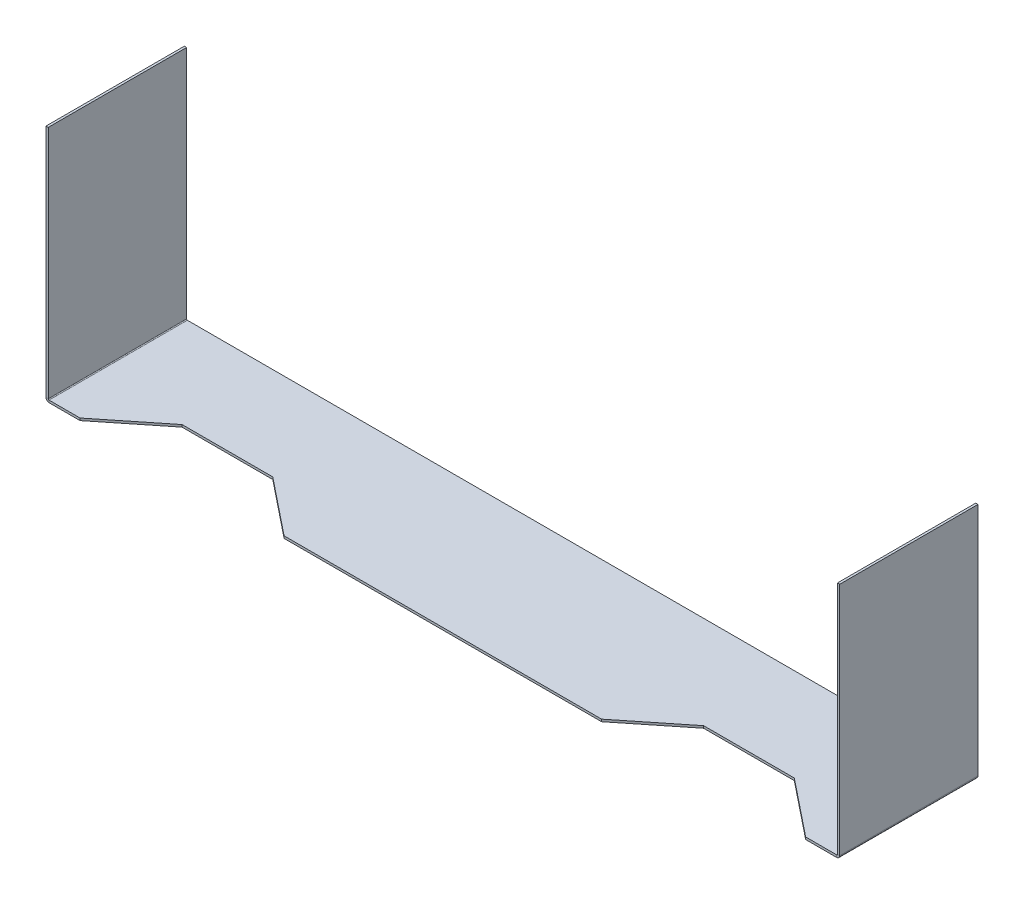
ISO-10303-21;
HEADER;
FILE_DESCRIPTION(('STEP AP214'),'2;1');
FILE_NAME('part.step','',(''),(''),'','','');
FILE_SCHEMA(('AUTOMOTIVE_DESIGN { 1 0 10303 214 1 1 1 1 }'));
ENDSEC;
DATA;
#1=APPLICATION_CONTEXT('core data for automotive mechanical design processes');
#2=APPLICATION_PROTOCOL_DEFINITION('international standard','automotive_design',2000,#1);
#3=PRODUCT_CONTEXT('',#1,'mechanical');
#4=PRODUCT('Part','Part','',(#3));
#5=PRODUCT_RELATED_PRODUCT_CATEGORY('part','',(#4));
#6=PRODUCT_DEFINITION_FORMATION('','',#4);
#7=PRODUCT_DEFINITION_CONTEXT('part definition',#1,'design');
#8=PRODUCT_DEFINITION('design','',#6,#7);
#9=PRODUCT_DEFINITION_SHAPE('','',#8);
#10=(LENGTH_UNIT() NAMED_UNIT(*) SI_UNIT(.MILLI.,.METRE.));
#11=(NAMED_UNIT(*) PLANE_ANGLE_UNIT() SI_UNIT($,.RADIAN.));
#12=(NAMED_UNIT(*) SI_UNIT($,.STERADIAN.) SOLID_ANGLE_UNIT());
#13=UNCERTAINTY_MEASURE_WITH_UNIT(LENGTH_MEASURE(1.E-05),#10,'distance_accuracy_value','');
#14=(GEOMETRIC_REPRESENTATION_CONTEXT(3) GLOBAL_UNCERTAINTY_ASSIGNED_CONTEXT((#13)) GLOBAL_UNIT_ASSIGNED_CONTEXT((#10,
#11,#12)) REPRESENTATION_CONTEXT('',''));
#15=CARTESIAN_POINT('',(0.,0.,0.));
#16=DIRECTION('',(0.,0.,1.));
#17=DIRECTION('',(1.,0.,0.));
#18=AXIS2_PLACEMENT_3D('',#15,#16,#17);
#19=CARTESIAN_POINT('',(698.,2.73660000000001,122.));
#20=DIRECTION('',(0.,0.,1.));
#21=DIRECTION('',(1.,0.,0.));
#22=AXIS2_PLACEMENT_3D('',#19,#20,#21);
#23=PLANE('',#22);
#24=DIRECTION('',(1.,0.,0.));
#25=VECTOR('',#24,1.);
#26=CARTESIAN_POINT('',(0.,0.,122.));
#27=LINE('',#26,#25);
#28=CARTESIAN_POINT('',(2.73659999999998,0.,122.));
#29=VERTEX_POINT('',#28);
#30=CARTESIAN_POINT('',(30.,0.,122.));
#31=VERTEX_POINT('',#30);
#32=EDGE_CURVE('E191',#29,#31,#27,.T.);
#33=ORIENTED_EDGE('',*,*,#32,.T.);
#34=DIRECTION('',(0.,1.,0.));
#35=VECTOR('',#34,1.);
#36=CARTESIAN_POINT('',(30.,2.,122.));
#37=LINE('',#36,#35);
#38=CARTESIAN_POINT('',(30.,2.,122.));
#39=VERTEX_POINT('',#38);
#40=EDGE_CURVE('E171',#39,#31,#37,.F.);
#41=ORIENTED_EDGE('',*,*,#40,.F.);
#42=DIRECTION('',(1.,0.,0.));
#43=VECTOR('',#42,1.);
#44=CARTESIAN_POINT('',(0.,2.,122.));
#45=LINE('',#44,#43);
#46=CARTESIAN_POINT('',(2.73659999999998,2.,122.));
#47=VERTEX_POINT('',#46);
#48=EDGE_CURVE('E226',#47,#39,#45,.T.);
#49=ORIENTED_EDGE('',*,*,#48,.F.);
#50=DIRECTION('',(0.,-1.,0.));
#51=VECTOR('',#50,1.);
#52=CARTESIAN_POINT('',(2.73659999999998,2.,122.));
#53=LINE('',#52,#51);
#54=EDGE_CURVE('E44',#47,#29,#53,.T.);
#55=ORIENTED_EDGE('',*,*,#54,.T.);
#56=EDGE_LOOP('',(#33,#41,#49,#55));
#57=FACE_BOUND('',#56,.T.);
#58=ADVANCED_FACE('F36',(#57),#23,.T.);
#59=CARTESIAN_POINT('',(210.,2.,122.));
#60=VERTEX_POINT('',#59);
#61=CARTESIAN_POINT('',(490.,2.,122.));
#62=VERTEX_POINT('',#61);
#63=EDGE_CURVE('E228',#60,#62,#45,.T.);
#64=ORIENTED_EDGE('',*,*,#63,.F.);
#65=DIRECTION('',(0.,1.,0.));
#66=VECTOR('',#65,1.);
#67=CARTESIAN_POINT('',(210.,2.,122.));
#68=LINE('',#67,#66);
#69=CARTESIAN_POINT('',(210.,0.,122.));
#70=VERTEX_POINT('',#69);
#71=EDGE_CURVE('E184',#60,#70,#68,.F.);
#72=ORIENTED_EDGE('',*,*,#71,.T.);
#73=CARTESIAN_POINT('',(490.,0.,122.));
#74=VERTEX_POINT('',#73);
#75=EDGE_CURVE('E197',#70,#74,#27,.T.);
#76=ORIENTED_EDGE('',*,*,#75,.T.);
#77=DIRECTION('',(0.,1.,0.));
#78=VECTOR('',#77,1.);
#79=CARTESIAN_POINT('',(490.,2.,122.));
#80=LINE('',#79,#78);
#81=EDGE_CURVE('E244',#62,#74,#80,.F.);
#82=ORIENTED_EDGE('',*,*,#81,.F.);
#83=EDGE_LOOP('',(#64,#72,#76,#82));
#84=FACE_BOUND('',#83,.T.);
#85=ADVANCED_FACE('F284',(#84),#23,.T.);
#86=CARTESIAN_POINT('',(0.,2.,122.));
#87=DIRECTION('',(0.,1.,0.));
#88=DIRECTION('',(0.,0.,1.));
#89=AXIS2_PLACEMENT_3D('',#86,#87,#88);
#90=PLANE('',#89);
#91=ORIENTED_EDGE('',*,*,#48,.T.);
#92=DIRECTION('',(-0.78086880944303,0.,0.624695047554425));
#93=VECTOR('',#92,1.);
#94=CARTESIAN_POINT('',(11.7073170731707,2.,136.634146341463));
#95=LINE('',#94,#93);
#96=CARTESIAN_POINT('',(80.,2.,82.));
#97=VERTEX_POINT('',#96);
#98=EDGE_CURVE('E178',#97,#39,#95,.T.);
#99=ORIENTED_EDGE('',*,*,#98,.F.);
#100=DIRECTION('',(-1.,0.,0.));
#101=VECTOR('',#100,1.);
#102=CARTESIAN_POINT('',(0.,2.,82.));
#103=LINE('',#102,#101);
#104=CARTESIAN_POINT('',(160.,2.,82.));
#105=VERTEX_POINT('',#104);
#106=EDGE_CURVE('E274',#105,#97,#103,.T.);
#107=ORIENTED_EDGE('',*,*,#106,.F.);
#108=DIRECTION('',(-0.78086880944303,0.,-0.624695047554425));
#109=VECTOR('',#108,1.);
#110=CARTESIAN_POINT('',(81.9512195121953,2.,19.5609756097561));
#111=LINE('',#110,#109);
#112=EDGE_CURVE('E276',#60,#105,#111,.T.);
#113=ORIENTED_EDGE('',*,*,#112,.F.);
#114=ORIENTED_EDGE('',*,*,#63,.T.);
#115=DIRECTION('',(-0.78086880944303,0.,0.624695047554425));
#116=VECTOR('',#115,1.);
#117=CARTESIAN_POINT('',(191.219512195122,2.,361.024390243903));
#118=LINE('',#117,#116);
#119=CARTESIAN_POINT('',(540.,2.,82.));
#120=VERTEX_POINT('',#119);
#121=EDGE_CURVE('E253',#120,#62,#118,.T.);
#122=ORIENTED_EDGE('',*,*,#121,.F.);
#123=DIRECTION('',(-1.,0.,0.));
#124=VECTOR('',#123,1.);
#125=CARTESIAN_POINT('',(0.,2.,81.9999999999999));
#126=LINE('',#125,#124);
#127=CARTESIAN_POINT('',(620.,2.,82.));
#128=VERTEX_POINT('',#127);
#129=EDGE_CURVE('E257',#128,#120,#126,.T.);
#130=ORIENTED_EDGE('',*,*,#129,.F.);
#131=DIRECTION('',(-0.78086880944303,0.,-0.624695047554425));
#132=VECTOR('',#131,1.);
#133=CARTESIAN_POINT('',(261.463414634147,2.,-204.829268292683));
#134=LINE('',#133,#132);
#135=CARTESIAN_POINT('',(670.,2.,122.));
#136=VERTEX_POINT('',#135);
#137=EDGE_CURVE('E259',#136,#128,#134,.T.);
#138=ORIENTED_EDGE('',*,*,#137,.F.);
#139=CARTESIAN_POINT('',(697.2634,2.,122.));
#140=VERTEX_POINT('',#139);
#141=EDGE_CURVE('E229',#136,#140,#45,.T.);
#142=ORIENTED_EDGE('',*,*,#141,.T.);
#143=DIRECTION('',(0.,0.,-1.));
#144=VECTOR('',#143,1.);
#145=CARTESIAN_POINT('',(697.2634,2.,122.));
#146=LINE('',#145,#144);
#147=CARTESIAN_POINT('',(697.2634,2.,0.));
#148=VERTEX_POINT('',#147);
#149=EDGE_CURVE('E294',#140,#148,#146,.T.);
#150=ORIENTED_EDGE('',*,*,#149,.T.);
#151=DIRECTION('',(1.,0.,0.));
#152=VECTOR('',#151,1.);
#153=CARTESIAN_POINT('',(0.,2.,0.));
#154=LINE('',#153,#152);
#155=CARTESIAN_POINT('',(2.73659999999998,2.,0.));
#156=VERTEX_POINT('',#155);
#157=EDGE_CURVE('E352',#156,#148,#154,.T.);
#158=ORIENTED_EDGE('',*,*,#157,.F.);
#159=DIRECTION('',(0.,0.,-1.));
#160=VECTOR('',#159,1.);
#161=CARTESIAN_POINT('',(2.73659999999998,2.,122.));
#162=LINE('',#161,#160);
#163=EDGE_CURVE('E312',#47,#156,#162,.T.);
#164=ORIENTED_EDGE('',*,*,#163,.F.);
#165=EDGE_LOOP('',(#91,#99,#107,#113,#114,#122,#130,#138,#142,#150,#158,#164));
#166=FACE_BOUND('',#165,.T.);
#167=ADVANCED_FACE('F291',(#166),#90,.T.);
#168=CARTESIAN_POINT('',(0.,0.,122.));
#169=DIRECTION('',(0.,1.,0.));
#170=DIRECTION('',(0.,0.,1.));
#171=AXIS2_PLACEMENT_3D('',#168,#169,#170);
#172=PLANE('',#171);
#173=DIRECTION('',(-0.78086880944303,0.,0.624695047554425));
#174=VECTOR('',#173,1.);
#175=CARTESIAN_POINT('',(11.7073170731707,0.,136.634146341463));
#176=LINE('',#175,#174);
#177=CARTESIAN_POINT('',(80.,0.,82.));
#178=VERTEX_POINT('',#177);
#179=EDGE_CURVE('E175',#178,#31,#176,.T.);
#180=ORIENTED_EDGE('',*,*,#179,.T.);
#181=ORIENTED_EDGE('',*,*,#32,.F.);
#182=DIRECTION('',(0.,0.,-1.));
#183=VECTOR('',#182,1.);
#184=CARTESIAN_POINT('',(2.73659999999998,0.,122.));
#185=LINE('',#184,#183);
#186=CARTESIAN_POINT('',(2.73659999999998,0.,0.));
#187=VERTEX_POINT('',#186);
#188=EDGE_CURVE('E393',#29,#187,#185,.T.);
#189=ORIENTED_EDGE('',*,*,#188,.T.);
#190=DIRECTION('',(1.,0.,0.));
#191=VECTOR('',#190,1.);
#192=CARTESIAN_POINT('',(0.,0.,0.));
#193=LINE('',#192,#191);
#194=CARTESIAN_POINT('',(697.2634,0.,0.));
#195=VERTEX_POINT('',#194);
#196=EDGE_CURVE('E354',#187,#195,#193,.T.);
#197=ORIENTED_EDGE('',*,*,#196,.T.);
#198=DIRECTION('',(0.,0.,-1.));
#199=VECTOR('',#198,1.);
#200=CARTESIAN_POINT('',(697.2634,0.,122.));
#201=LINE('',#200,#199);
#202=CARTESIAN_POINT('',(697.2634,0.,122.));
#203=VERTEX_POINT('',#202);
#204=EDGE_CURVE('E390',#203,#195,#201,.T.);
#205=ORIENTED_EDGE('',*,*,#204,.F.);
#206=CARTESIAN_POINT('',(670.,0.,122.));
#207=VERTEX_POINT('',#206);
#208=EDGE_CURVE('E199',#207,#203,#27,.T.);
#209=ORIENTED_EDGE('',*,*,#208,.F.);
#210=DIRECTION('',(-0.78086880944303,0.,-0.624695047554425));
#211=VECTOR('',#210,1.);
#212=CARTESIAN_POINT('',(261.463414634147,0.,-204.829268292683));
#213=LINE('',#212,#211);
#214=CARTESIAN_POINT('',(620.,0.,81.9999999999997));
#215=VERTEX_POINT('',#214);
#216=EDGE_CURVE('E256',#207,#215,#213,.T.);
#217=ORIENTED_EDGE('',*,*,#216,.T.);
#218=DIRECTION('',(1.,0.,0.));
#219=VECTOR('',#218,1.);
#220=CARTESIAN_POINT('',(0.,0.,82.));
#221=LINE('',#220,#219);
#222=CARTESIAN_POINT('',(540.,0.,82.));
#223=VERTEX_POINT('',#222);
#224=EDGE_CURVE('E263',#215,#223,#221,.F.);
#225=ORIENTED_EDGE('',*,*,#224,.T.);
#226=DIRECTION('',(-0.78086880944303,0.,0.624695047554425));
#227=VECTOR('',#226,1.);
#228=CARTESIAN_POINT('',(191.219512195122,0.,361.024390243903));
#229=LINE('',#228,#227);
#230=EDGE_CURVE('E245',#223,#74,#229,.T.);
#231=ORIENTED_EDGE('',*,*,#230,.T.);
#232=ORIENTED_EDGE('',*,*,#75,.F.);
#233=DIRECTION('',(-0.78086880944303,0.,-0.624695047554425));
#234=VECTOR('',#233,1.);
#235=CARTESIAN_POINT('',(81.9512195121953,0.,19.5609756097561));
#236=LINE('',#235,#234);
#237=CARTESIAN_POINT('',(160.,0.,81.9999999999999));
#238=VERTEX_POINT('',#237);
#239=EDGE_CURVE('E273',#70,#238,#236,.T.);
#240=ORIENTED_EDGE('',*,*,#239,.T.);
#241=DIRECTION('',(1.,0.,0.));
#242=VECTOR('',#241,1.);
#243=CARTESIAN_POINT('',(0.,0.,82.));
#244=LINE('',#243,#242);
#245=EDGE_CURVE('E193',#238,#178,#244,.F.);
#246=ORIENTED_EDGE('',*,*,#245,.T.);
#247=EDGE_LOOP('',(#180,#181,#189,#197,#205,#209,#217,#225,#231,#232,#240,#246));
#248=FACE_BOUND('',#247,.T.);
#249=ADVANCED_FACE('F189',(#248),#172,.F.);
#250=ORIENTED_EDGE('',*,*,#141,.F.);
#251=DIRECTION('',(0.,1.,0.));
#252=VECTOR('',#251,1.);
#253=CARTESIAN_POINT('',(670.,2.,122.));
#254=LINE('',#253,#252);
#255=EDGE_CURVE('E242',#136,#207,#254,.F.);
#256=ORIENTED_EDGE('',*,*,#255,.T.);
#257=ORIENTED_EDGE('',*,*,#208,.T.);
#258=DIRECTION('',(0.,1.,0.));
#259=VECTOR('',#258,1.);
#260=CARTESIAN_POINT('',(697.2634,0.,122.));
#261=LINE('',#260,#259);
#262=EDGE_CURVE('E297',#203,#140,#261,.T.);
#263=ORIENTED_EDGE('',*,*,#262,.T.);
#264=EDGE_LOOP('',(#250,#256,#257,#263));
#265=FACE_BOUND('',#264,.T.);
#266=ADVANCED_FACE('F298',(#265),#23,.T.);
#267=CARTESIAN_POINT('',(0.,2.73660000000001,122.));
#268=DIRECTION('',(0.,0.,1.));
#269=DIRECTION('',(1.,0.,0.));
#270=AXIS2_PLACEMENT_3D('',#267,#268,#269);
#271=PLANE('',#270);
#272=DIRECTION('',(1.,0.,0.));
#273=VECTOR('',#272,1.);
#274=CARTESIAN_POINT('',(0.,2.73660000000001,122.));
#275=LINE('',#274,#273);
#276=CARTESIAN_POINT('',(0.,2.73660000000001,122.));
#277=VERTEX_POINT('',#276);
#278=CARTESIAN_POINT('',(2.,2.73660000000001,122.));
#279=VERTEX_POINT('',#278);
#280=EDGE_CURVE('E11',#277,#279,#275,.T.);
#281=ORIENTED_EDGE('',*,*,#280,.F.);
#282=CARTESIAN_POINT('',(2.73659999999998,2.73660000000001,122.));
#283=DIRECTION('',(0.,0.,-1.));
#284=DIRECTION('',(-1.,0.,0.));
#285=AXIS2_PLACEMENT_3D('',#282,#283,#284);
#286=CIRCLE('',#285,2.7366);
#287=EDGE_CURVE('E204',#277,#29,#286,.F.);
#288=ORIENTED_EDGE('',*,*,#287,.T.);
#289=ORIENTED_EDGE('',*,*,#54,.F.);
#290=CARTESIAN_POINT('',(2.73659999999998,2.73660000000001,122.));
#291=DIRECTION('',(0.,0.,1.));
#292=DIRECTION('',(1.,0.,0.));
#293=AXIS2_PLACEMENT_3D('',#290,#291,#292);
#294=CIRCLE('',#293,0.7366);
#295=EDGE_CURVE('E223',#279,#47,#294,.T.);
#296=ORIENTED_EDGE('',*,*,#295,.F.);
#297=EDGE_LOOP('',(#281,#288,#289,#296));
#298=FACE_BOUND('',#297,.T.);
#299=ADVANCED_FACE('F38',(#298),#271,.T.);
#300=CARTESIAN_POINT('',(2.73659999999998,2.,122.));
#301=DIRECTION('',(0.,0.,1.));
#302=DIRECTION('',(1.,0.,0.));
#303=AXIS2_PLACEMENT_3D('',#300,#301,#302);
#304=PLANE('',#303);
#305=DIRECTION('',(0.,-1.,0.));
#306=VECTOR('',#305,1.);
#307=CARTESIAN_POINT('',(0.,210.,122.));
#308=LINE('',#307,#306);
#309=CARTESIAN_POINT('',(0.,210.,122.));
#310=VERTEX_POINT('',#309);
#311=EDGE_CURVE('E210',#310,#277,#308,.T.);
#312=ORIENTED_EDGE('',*,*,#311,.T.);
#313=ORIENTED_EDGE('',*,*,#280,.T.);
#314=DIRECTION('',(0.,-1.,0.));
#315=VECTOR('',#314,1.);
#316=CARTESIAN_POINT('',(2.,210.,122.));
#317=LINE('',#316,#315);
#318=CARTESIAN_POINT('',(2.,210.,122.));
#319=VERTEX_POINT('',#318);
#320=EDGE_CURVE('E220',#319,#279,#317,.T.);
#321=ORIENTED_EDGE('',*,*,#320,.F.);
#322=DIRECTION('',(1.,0.,0.));
#323=VECTOR('',#322,1.);
#324=CARTESIAN_POINT('',(0.,210.,122.));
#325=LINE('',#324,#323);
#326=EDGE_CURVE('E215',#310,#319,#325,.T.);
#327=ORIENTED_EDGE('',*,*,#326,.F.);
#328=EDGE_LOOP('',(#312,#313,#321,#327));
#329=FACE_BOUND('',#328,.T.);
#330=ADVANCED_FACE('F410',(#329),#304,.T.);
#331=CARTESIAN_POINT('',(2.73659999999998,0.,0.));
#332=DIRECTION('',(0.,0.,-1.));
#333=DIRECTION('',(-1.,0.,0.));
#334=AXIS2_PLACEMENT_3D('',#331,#332,#333);
#335=PLANE('',#334);
#336=DIRECTION('',(0.,1.,0.));
#337=VECTOR('',#336,1.);
#338=CARTESIAN_POINT('',(2.73659999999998,0.,0.));
#339=LINE('',#338,#337);
#340=EDGE_CURVE('E347',#187,#156,#339,.T.);
#341=ORIENTED_EDGE('',*,*,#340,.F.);
#342=CARTESIAN_POINT('',(2.73659999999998,2.73660000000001,0.));
#343=DIRECTION('',(0.,0.,-1.));
#344=DIRECTION('',(-1.,0.,0.));
#345=AXIS2_PLACEMENT_3D('',#342,#343,#344);
#346=CIRCLE('',#345,2.7366);
#347=CARTESIAN_POINT('',(0.,2.73660000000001,0.));
#348=VERTEX_POINT('',#347);
#349=EDGE_CURVE('E383',#348,#187,#346,.F.);
#350=ORIENTED_EDGE('',*,*,#349,.F.);
#351=DIRECTION('',(-1.,0.,0.));
#352=VECTOR('',#351,1.);
#353=CARTESIAN_POINT('',(2.,2.73660000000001,0.));
#354=LINE('',#353,#352);
#355=CARTESIAN_POINT('',(2.,2.73660000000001,0.));
#356=VERTEX_POINT('',#355);
#357=EDGE_CURVE('E302',#356,#348,#354,.T.);
#358=ORIENTED_EDGE('',*,*,#357,.F.);
#359=CARTESIAN_POINT('',(2.73659999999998,2.73660000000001,0.));
#360=DIRECTION('',(0.,0.,1.));
#361=DIRECTION('',(1.,0.,0.));
#362=AXIS2_PLACEMENT_3D('',#359,#360,#361);
#363=CIRCLE('',#362,0.7366);
#364=EDGE_CURVE('E364',#356,#156,#363,.T.);
#365=ORIENTED_EDGE('',*,*,#364,.T.);
#366=EDGE_LOOP('',(#341,#350,#358,#365));
#367=FACE_BOUND('',#366,.T.);
#368=ADVANCED_FACE('F370',(#367),#335,.T.);
#369=CARTESIAN_POINT('',(2.,2.73660000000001,0.));
#370=DIRECTION('',(0.,0.,-1.));
#371=DIRECTION('',(-1.,0.,0.));
#372=AXIS2_PLACEMENT_3D('',#369,#370,#371);
#373=PLANE('',#372);
#374=ORIENTED_EDGE('',*,*,#196,.F.);
#375=ORIENTED_EDGE('',*,*,#340,.T.);
#376=ORIENTED_EDGE('',*,*,#157,.T.);
#377=DIRECTION('',(0.,-1.,0.));
#378=VECTOR('',#377,1.);
#379=CARTESIAN_POINT('',(697.2634,2.,0.));
#380=LINE('',#379,#378);
#381=EDGE_CURVE('E341',#148,#195,#380,.T.);
#382=ORIENTED_EDGE('',*,*,#381,.T.);
#383=EDGE_LOOP('',(#374,#375,#376,#382));
#384=FACE_BOUND('',#383,.T.);
#385=ADVANCED_FACE('F351',(#384),#373,.T.);
#386=CARTESIAN_POINT('',(697.2634,0.,122.));
#387=DIRECTION('',(0.,0.,1.));
#388=DIRECTION('',(1.,0.,0.));
#389=AXIS2_PLACEMENT_3D('',#386,#387,#388);
#390=PLANE('',#389);
#391=ORIENTED_EDGE('',*,*,#262,.F.);
#392=CARTESIAN_POINT('',(697.2634,2.73660000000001,122.));
#393=DIRECTION('',(0.,0.,-1.));
#394=DIRECTION('',(-1.,0.,0.));
#395=AXIS2_PLACEMENT_3D('',#392,#393,#394);
#396=CIRCLE('',#395,2.7366);
#397=CARTESIAN_POINT('',(700.,2.73660000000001,122.));
#398=VERTEX_POINT('',#397);
#399=EDGE_CURVE('E196',#203,#398,#396,.F.);
#400=ORIENTED_EDGE('',*,*,#399,.T.);
#401=DIRECTION('',(1.,0.,0.));
#402=VECTOR('',#401,1.);
#403=CARTESIAN_POINT('',(698.,2.73660000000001,122.));
#404=LINE('',#403,#402);
#405=CARTESIAN_POINT('',(698.,2.73660000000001,122.));
#406=VERTEX_POINT('',#405);
#407=EDGE_CURVE('E303',#406,#398,#404,.T.);
#408=ORIENTED_EDGE('',*,*,#407,.F.);
#409=CARTESIAN_POINT('',(697.2634,2.73660000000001,122.));
#410=DIRECTION('',(0.,0.,1.));
#411=DIRECTION('',(1.,0.,0.));
#412=AXIS2_PLACEMENT_3D('',#409,#410,#411);
#413=CIRCLE('',#412,0.7366);
#414=EDGE_CURVE('E230',#140,#406,#413,.T.);
#415=ORIENTED_EDGE('',*,*,#414,.F.);
#416=EDGE_LOOP('',(#391,#400,#408,#415));
#417=FACE_BOUND('',#416,.T.);
#418=ADVANCED_FACE('F314',(#417),#390,.T.);
#419=CARTESIAN_POINT('',(700.,2.73660000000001,0.));
#420=DIRECTION('',(0.,0.,-1.));
#421=DIRECTION('',(-1.,0.,0.));
#422=AXIS2_PLACEMENT_3D('',#419,#420,#421);
#423=PLANE('',#422);
#424=DIRECTION('',(-1.,0.,0.));
#425=VECTOR('',#424,1.);
#426=CARTESIAN_POINT('',(700.,2.73660000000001,0.));
#427=LINE('',#426,#425);
#428=CARTESIAN_POINT('',(700.,2.73660000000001,0.));
#429=VERTEX_POINT('',#428);
#430=CARTESIAN_POINT('',(698.,2.73660000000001,0.));
#431=VERTEX_POINT('',#430);
#432=EDGE_CURVE('E320',#429,#431,#427,.T.);
#433=ORIENTED_EDGE('',*,*,#432,.F.);
#434=CARTESIAN_POINT('',(697.2634,2.73660000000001,0.));
#435=DIRECTION('',(0.,0.,-1.));
#436=DIRECTION('',(-1.,0.,0.));
#437=AXIS2_PLACEMENT_3D('',#434,#435,#436);
#438=CIRCLE('',#437,2.7366);
#439=EDGE_CURVE('E241',#195,#429,#438,.F.);
#440=ORIENTED_EDGE('',*,*,#439,.F.);
#441=ORIENTED_EDGE('',*,*,#381,.F.);
#442=CARTESIAN_POINT('',(697.2634,2.73660000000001,0.));
#443=DIRECTION('',(0.,0.,1.));
#444=DIRECTION('',(1.,0.,0.));
#445=AXIS2_PLACEMENT_3D('',#442,#443,#444);
#446=CIRCLE('',#445,0.7366);
#447=EDGE_CURVE('E309',#148,#431,#446,.T.);
#448=ORIENTED_EDGE('',*,*,#447,.T.);
#449=EDGE_LOOP('',(#433,#440,#441,#448));
#450=FACE_BOUND('',#449,.T.);
#451=ADVANCED_FACE('F420',(#450),#423,.T.);
#452=CARTESIAN_POINT('',(697.2634,2.,0.));
#453=DIRECTION('',(0.,0.,-1.));
#454=DIRECTION('',(-1.,0.,0.));
#455=AXIS2_PLACEMENT_3D('',#452,#453,#454);
#456=PLANE('',#455);
#457=DIRECTION('',(0.,1.,0.));
#458=VECTOR('',#457,1.);
#459=CARTESIAN_POINT('',(700.,0.,0.));
#460=LINE('',#459,#458);
#461=CARTESIAN_POINT('',(700.,210.,0.));
#462=VERTEX_POINT('',#461);
#463=EDGE_CURVE('E247',#429,#462,#460,.T.);
#464=ORIENTED_EDGE('',*,*,#463,.F.);
#465=ORIENTED_EDGE('',*,*,#432,.T.);
#466=DIRECTION('',(0.,1.,0.));
#467=VECTOR('',#466,1.);
#468=CARTESIAN_POINT('',(698.,0.,0.));
#469=LINE('',#468,#467);
#470=CARTESIAN_POINT('',(698.,210.,0.));
#471=VERTEX_POINT('',#470);
#472=EDGE_CURVE('E326',#431,#471,#469,.T.);
#473=ORIENTED_EDGE('',*,*,#472,.T.);
#474=DIRECTION('',(1.,0.,0.));
#475=VECTOR('',#474,1.);
#476=CARTESIAN_POINT('',(698.,210.,0.));
#477=LINE('',#476,#475);
#478=EDGE_CURVE('E339',#471,#462,#477,.T.);
#479=ORIENTED_EDGE('',*,*,#478,.T.);
#480=EDGE_LOOP('',(#464,#465,#473,#479));
#481=FACE_BOUND('',#480,.T.);
#482=ADVANCED_FACE('F423',(#481),#456,.T.);
#483=CARTESIAN_POINT('',(700.,0.,122.));
#484=DIRECTION('',(-1.,0.,0.));
#485=DIRECTION('',(0.,0.,1.));
#486=AXIS2_PLACEMENT_3D('',#483,#484,#485);
#487=PLANE('',#486);
#488=ORIENTED_EDGE('',*,*,#463,.T.);
#489=DIRECTION('',(0.,0.,-1.));
#490=VECTOR('',#489,1.);
#491=CARTESIAN_POINT('',(700.,210.,122.));
#492=LINE('',#491,#490);
#493=CARTESIAN_POINT('',(700.,210.,122.));
#494=VERTEX_POINT('',#493);
#495=EDGE_CURVE('E336',#494,#462,#492,.T.);
#496=ORIENTED_EDGE('',*,*,#495,.F.);
#497=DIRECTION('',(0.,1.,0.));
#498=VECTOR('',#497,1.);
#499=CARTESIAN_POINT('',(700.,0.,122.));
#500=LINE('',#499,#498);
#501=EDGE_CURVE('E239',#398,#494,#500,.T.);
#502=ORIENTED_EDGE('',*,*,#501,.F.);
#503=DIRECTION('',(0.,0.,-1.));
#504=VECTOR('',#503,1.);
#505=CARTESIAN_POINT('',(700.,2.73660000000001,122.));
#506=LINE('',#505,#504);
#507=EDGE_CURVE('E201',#398,#429,#506,.T.);
#508=ORIENTED_EDGE('',*,*,#507,.T.);
#509=EDGE_LOOP('',(#488,#496,#502,#508));
#510=FACE_BOUND('',#509,.T.);
#511=ADVANCED_FACE('F428',(#510),#487,.F.);
#512=CARTESIAN_POINT('',(698.,210.,122.));
#513=DIRECTION('',(0.,1.,0.));
#514=DIRECTION('',(0.,0.,1.));
#515=AXIS2_PLACEMENT_3D('',#512,#513,#514);
#516=PLANE('',#515);
#517=ORIENTED_EDGE('',*,*,#478,.F.);
#518=DIRECTION('',(0.,0.,-1.));
#519=VECTOR('',#518,1.);
#520=CARTESIAN_POINT('',(698.,210.,122.));
#521=LINE('',#520,#519);
#522=CARTESIAN_POINT('',(698.,210.,122.));
#523=VERTEX_POINT('',#522);
#524=EDGE_CURVE('E327',#523,#471,#521,.T.);
#525=ORIENTED_EDGE('',*,*,#524,.F.);
#526=DIRECTION('',(1.,0.,0.));
#527=VECTOR('',#526,1.);
#528=CARTESIAN_POINT('',(698.,210.,122.));
#529=LINE('',#528,#527);
#530=EDGE_CURVE('E236',#523,#494,#529,.T.);
#531=ORIENTED_EDGE('',*,*,#530,.T.);
#532=ORIENTED_EDGE('',*,*,#495,.T.);
#533=EDGE_LOOP('',(#517,#525,#531,#532));
#534=FACE_BOUND('',#533,.T.);
#535=ADVANCED_FACE('F335',(#534),#516,.T.);
#536=CARTESIAN_POINT('',(698.,0.,122.));
#537=DIRECTION('',(-1.,0.,0.));
#538=DIRECTION('',(0.,0.,1.));
#539=AXIS2_PLACEMENT_3D('',#536,#537,#538);
#540=PLANE('',#539);
#541=ORIENTED_EDGE('',*,*,#472,.F.);
#542=DIRECTION('',(0.,0.,-1.));
#543=VECTOR('',#542,1.);
#544=CARTESIAN_POINT('',(698.,2.73660000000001,122.));
#545=LINE('',#544,#543);
#546=EDGE_CURVE('E311',#406,#431,#545,.T.);
#547=ORIENTED_EDGE('',*,*,#546,.F.);
#548=DIRECTION('',(0.,1.,0.));
#549=VECTOR('',#548,1.);
#550=CARTESIAN_POINT('',(698.,0.,122.));
#551=LINE('',#550,#549);
#552=EDGE_CURVE('E233',#406,#523,#551,.T.);
#553=ORIENTED_EDGE('',*,*,#552,.T.);
#554=ORIENTED_EDGE('',*,*,#524,.T.);
#555=EDGE_LOOP('',(#541,#547,#553,#554));
#556=FACE_BOUND('',#555,.T.);
#557=ADVANCED_FACE('F324',(#556),#540,.T.);
#558=CARTESIAN_POINT('',(697.2634,2.73660000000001,122.));
#559=DIRECTION('',(0.,0.,-1.));
#560=DIRECTION('',(-1.,0.,0.));
#561=AXIS2_PLACEMENT_3D('',#558,#559,#560);
#562=CYLINDRICAL_SURFACE('',#561,0.7366);
#563=ORIENTED_EDGE('',*,*,#447,.F.);
#564=ORIENTED_EDGE('',*,*,#149,.F.);
#565=ORIENTED_EDGE('',*,*,#414,.T.);
#566=ORIENTED_EDGE('',*,*,#546,.T.);
#567=EDGE_LOOP('',(#563,#564,#565,#566));
#568=FACE_BOUND('',#567,.T.);
#569=ADVANCED_FACE('F306',(#568),#562,.F.);
#570=CARTESIAN_POINT('',(2.73659999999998,2.73660000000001,122.));
#571=DIRECTION('',(0.,0.,-1.));
#572=DIRECTION('',(-1.,0.,0.));
#573=AXIS2_PLACEMENT_3D('',#570,#571,#572);
#574=CYLINDRICAL_SURFACE('',#573,0.7366);
#575=ORIENTED_EDGE('',*,*,#364,.F.);
#576=DIRECTION('',(0.,0.,-1.));
#577=VECTOR('',#576,1.);
#578=CARTESIAN_POINT('',(2.,2.73660000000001,122.));
#579=LINE('',#578,#577);
#580=EDGE_CURVE('E367',#279,#356,#579,.T.);
#581=ORIENTED_EDGE('',*,*,#580,.F.);
#582=ORIENTED_EDGE('',*,*,#295,.T.);
#583=ORIENTED_EDGE('',*,*,#163,.T.);
#584=EDGE_LOOP('',(#575,#581,#582,#583));
#585=FACE_BOUND('',#584,.T.);
#586=ADVANCED_FACE('F362',(#585),#574,.F.);
#587=CARTESIAN_POINT('',(2.,210.,122.));
#588=DIRECTION('',(1.,0.,0.));
#589=DIRECTION('',(0.,1.,0.));
#590=AXIS2_PLACEMENT_3D('',#587,#588,#589);
#591=PLANE('',#590);
#592=DIRECTION('',(0.,-1.,0.));
#593=VECTOR('',#592,1.);
#594=CARTESIAN_POINT('',(2.,210.,0.));
#595=LINE('',#594,#593);
#596=CARTESIAN_POINT('',(2.,210.,0.));
#597=VERTEX_POINT('',#596);
#598=EDGE_CURVE('E372',#597,#356,#595,.T.);
#599=ORIENTED_EDGE('',*,*,#598,.F.);
#600=DIRECTION('',(0.,0.,-1.));
#601=VECTOR('',#600,1.);
#602=CARTESIAN_POINT('',(2.,210.,122.));
#603=LINE('',#602,#601);
#604=EDGE_CURVE('E400',#319,#597,#603,.T.);
#605=ORIENTED_EDGE('',*,*,#604,.F.);
#606=ORIENTED_EDGE('',*,*,#320,.T.);
#607=ORIENTED_EDGE('',*,*,#580,.T.);
#608=EDGE_LOOP('',(#599,#605,#606,#607));
#609=FACE_BOUND('',#608,.T.);
#610=ADVANCED_FACE('F404',(#609),#591,.T.);
#611=CARTESIAN_POINT('',(0.,210.,122.));
#612=DIRECTION('',(0.,1.,0.));
#613=DIRECTION('',(0.,0.,1.));
#614=AXIS2_PLACEMENT_3D('',#611,#612,#613);
#615=PLANE('',#614);
#616=DIRECTION('',(1.,0.,0.));
#617=VECTOR('',#616,1.);
#618=CARTESIAN_POINT('',(0.,210.,0.));
#619=LINE('',#618,#617);
#620=CARTESIAN_POINT('',(0.,210.,0.));
#621=VERTEX_POINT('',#620);
#622=EDGE_CURVE('E374',#621,#597,#619,.T.);
#623=ORIENTED_EDGE('',*,*,#622,.F.);
#624=DIRECTION('',(0.,0.,-1.));
#625=VECTOR('',#624,1.);
#626=CARTESIAN_POINT('',(0.,210.,122.));
#627=LINE('',#626,#625);
#628=EDGE_CURVE('E398',#310,#621,#627,.T.);
#629=ORIENTED_EDGE('',*,*,#628,.F.);
#630=ORIENTED_EDGE('',*,*,#326,.T.);
#631=ORIENTED_EDGE('',*,*,#604,.T.);
#632=EDGE_LOOP('',(#623,#629,#630,#631));
#633=FACE_BOUND('',#632,.T.);
#634=ADVANCED_FACE('F461',(#633),#615,.T.);
#635=CARTESIAN_POINT('',(0.,210.,122.));
#636=DIRECTION('',(1.,0.,0.));
#637=DIRECTION('',(0.,1.,0.));
#638=AXIS2_PLACEMENT_3D('',#635,#636,#637);
#639=PLANE('',#638);
#640=DIRECTION('',(0.,-1.,0.));
#641=VECTOR('',#640,1.);
#642=CARTESIAN_POINT('',(0.,210.,0.));
#643=LINE('',#642,#641);
#644=EDGE_CURVE('E380',#621,#348,#643,.T.);
#645=ORIENTED_EDGE('',*,*,#644,.T.);
#646=DIRECTION('',(0.,0.,-1.));
#647=VECTOR('',#646,1.);
#648=CARTESIAN_POINT('',(0.,2.73660000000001,122.));
#649=LINE('',#648,#647);
#650=EDGE_CURVE('E395',#277,#348,#649,.T.);
#651=ORIENTED_EDGE('',*,*,#650,.F.);
#652=ORIENTED_EDGE('',*,*,#311,.F.);
#653=ORIENTED_EDGE('',*,*,#628,.T.);
#654=EDGE_LOOP('',(#645,#651,#652,#653));
#655=FACE_BOUND('',#654,.T.);
#656=ADVANCED_FACE('F412',(#655),#639,.F.);
#657=CARTESIAN_POINT('',(2.73659999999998,2.73660000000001,122.));
#658=DIRECTION('',(0.,0.,-1.));
#659=DIRECTION('',(-1.,0.,0.));
#660=AXIS2_PLACEMENT_3D('',#657,#658,#659);
#661=CYLINDRICAL_SURFACE('',#660,2.7366);
#662=ORIENTED_EDGE('',*,*,#349,.T.);
#663=ORIENTED_EDGE('',*,*,#188,.F.);
#664=ORIENTED_EDGE('',*,*,#287,.F.);
#665=ORIENTED_EDGE('',*,*,#650,.T.);
#666=EDGE_LOOP('',(#662,#663,#664,#665));
#667=FACE_BOUND('',#666,.T.);
#668=ADVANCED_FACE('F415',(#667),#661,.T.);
#669=CARTESIAN_POINT('',(697.2634,2.73660000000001,122.));
#670=DIRECTION('',(0.,0.,-1.));
#671=DIRECTION('',(-1.,0.,0.));
#672=AXIS2_PLACEMENT_3D('',#669,#670,#671);
#673=CYLINDRICAL_SURFACE('',#672,2.7366);
#674=ORIENTED_EDGE('',*,*,#439,.T.);
#675=ORIENTED_EDGE('',*,*,#507,.F.);
#676=ORIENTED_EDGE('',*,*,#399,.F.);
#677=ORIENTED_EDGE('',*,*,#204,.T.);
#678=EDGE_LOOP('',(#674,#675,#676,#677));
#679=FACE_BOUND('',#678,.T.);
#680=ADVANCED_FACE('F418',(#679),#673,.T.);
#681=CARTESIAN_POINT('',(697.2634,2.73660000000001,122.));
#682=DIRECTION('',(0.,0.,1.));
#683=DIRECTION('',(1.,0.,0.));
#684=AXIS2_PLACEMENT_3D('',#681,#682,#683);
#685=PLANE('',#684);
#686=ORIENTED_EDGE('',*,*,#501,.T.);
#687=ORIENTED_EDGE('',*,*,#530,.F.);
#688=ORIENTED_EDGE('',*,*,#552,.F.);
#689=ORIENTED_EDGE('',*,*,#407,.T.);
#690=EDGE_LOOP('',(#686,#687,#688,#689));
#691=FACE_BOUND('',#690,.T.);
#692=ADVANCED_FACE('F330',(#691),#685,.T.);
#693=CARTESIAN_POINT('',(697.2634,2.73660000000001,0.));
#694=DIRECTION('',(0.,0.,1.));
#695=DIRECTION('',(1.,0.,0.));
#696=AXIS2_PLACEMENT_3D('',#693,#694,#695);
#697=PLANE('',#696);
#698=ORIENTED_EDGE('',*,*,#598,.T.);
#699=ORIENTED_EDGE('',*,*,#357,.T.);
#700=ORIENTED_EDGE('',*,*,#644,.F.);
#701=ORIENTED_EDGE('',*,*,#622,.T.);
#702=EDGE_LOOP('',(#698,#699,#700,#701));
#703=FACE_BOUND('',#702,.T.);
#704=ADVANCED_FACE('F511',(#703),#697,.F.);
#705=CARTESIAN_POINT('',(0.,2.,81.9999999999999));
#706=DIRECTION('',(0.,0.,-1.));
#707=DIRECTION('',(-1.,0.,0.));
#708=AXIS2_PLACEMENT_3D('',#705,#706,#707);
#709=PLANE('',#708);
#710=DIRECTION('',(0.,1.,0.));
#711=VECTOR('',#710,1.);
#712=CARTESIAN_POINT('',(620.,2.,82.));
#713=LINE('',#712,#711);
#714=EDGE_CURVE('E59',#128,#215,#713,.F.);
#715=ORIENTED_EDGE('',*,*,#714,.F.);
#716=ORIENTED_EDGE('',*,*,#129,.T.);
#717=DIRECTION('',(0.,1.,0.));
#718=VECTOR('',#717,1.);
#719=CARTESIAN_POINT('',(540.,2.,82.));
#720=LINE('',#719,#718);
#721=EDGE_CURVE('E248',#120,#223,#720,.F.);
#722=ORIENTED_EDGE('',*,*,#721,.T.);
#723=ORIENTED_EDGE('',*,*,#224,.F.);
#724=EDGE_LOOP('',(#715,#716,#722,#723));
#725=FACE_BOUND('',#724,.T.);
#726=ADVANCED_FACE('F518',(#725),#709,.F.);
#727=CARTESIAN_POINT('',(191.219512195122,2.,361.024390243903));
#728=DIRECTION('',(-0.624695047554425,0.,-0.78086880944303));
#729=DIRECTION('',(-0.78086880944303,0.,0.624695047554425));
#730=AXIS2_PLACEMENT_3D('',#727,#728,#729);
#731=PLANE('',#730);
#732=ORIENTED_EDGE('',*,*,#721,.F.);
#733=ORIENTED_EDGE('',*,*,#121,.T.);
#734=ORIENTED_EDGE('',*,*,#81,.T.);
#735=ORIENTED_EDGE('',*,*,#230,.F.);
#736=EDGE_LOOP('',(#732,#733,#734,#735));
#737=FACE_BOUND('',#736,.T.);
#738=ADVANCED_FACE('F525',(#737),#731,.F.);
#739=CARTESIAN_POINT('',(261.463414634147,2.,-204.829268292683));
#740=DIRECTION('',(0.624695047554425,0.,-0.78086880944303));
#741=DIRECTION('',(-0.78086880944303,0.,-0.624695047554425));
#742=AXIS2_PLACEMENT_3D('',#739,#740,#741);
#743=PLANE('',#742);
#744=ORIENTED_EDGE('',*,*,#137,.T.);
#745=ORIENTED_EDGE('',*,*,#714,.T.);
#746=ORIENTED_EDGE('',*,*,#216,.F.);
#747=ORIENTED_EDGE('',*,*,#255,.F.);
#748=EDGE_LOOP('',(#744,#745,#746,#747));
#749=FACE_BOUND('',#748,.T.);
#750=ADVANCED_FACE('F533',(#749),#743,.F.);
#751=CARTESIAN_POINT('',(0.,2.,82.));
#752=DIRECTION('',(0.,0.,-1.));
#753=DIRECTION('',(-1.,0.,0.));
#754=AXIS2_PLACEMENT_3D('',#751,#752,#753);
#755=PLANE('',#754);
#756=DIRECTION('',(0.,1.,0.));
#757=VECTOR('',#756,1.);
#758=CARTESIAN_POINT('',(160.,2.,82.));
#759=LINE('',#758,#757);
#760=EDGE_CURVE('E51',#105,#238,#759,.F.);
#761=ORIENTED_EDGE('',*,*,#760,.F.);
#762=ORIENTED_EDGE('',*,*,#106,.T.);
#763=DIRECTION('',(0.,1.,0.));
#764=VECTOR('',#763,1.);
#765=CARTESIAN_POINT('',(80.,2.,82.));
#766=LINE('',#765,#764);
#767=EDGE_CURVE('E183',#97,#178,#766,.F.);
#768=ORIENTED_EDGE('',*,*,#767,.T.);
#769=ORIENTED_EDGE('',*,*,#245,.F.);
#770=EDGE_LOOP('',(#761,#762,#768,#769));
#771=FACE_BOUND('',#770,.T.);
#772=ADVANCED_FACE('F541',(#771),#755,.F.);
#773=CARTESIAN_POINT('',(11.7073170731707,2.,136.634146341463));
#774=DIRECTION('',(-0.624695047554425,0.,-0.78086880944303));
#775=DIRECTION('',(-0.78086880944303,0.,0.624695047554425));
#776=AXIS2_PLACEMENT_3D('',#773,#774,#775);
#777=PLANE('',#776);
#778=ORIENTED_EDGE('',*,*,#767,.F.);
#779=ORIENTED_EDGE('',*,*,#98,.T.);
#780=ORIENTED_EDGE('',*,*,#40,.T.);
#781=ORIENTED_EDGE('',*,*,#179,.F.);
#782=EDGE_LOOP('',(#778,#779,#780,#781));
#783=FACE_BOUND('',#782,.T.);
#784=ADVANCED_FACE('F174',(#783),#777,.F.);
#785=CARTESIAN_POINT('',(81.9512195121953,2.,19.5609756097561));
#786=DIRECTION('',(0.624695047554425,0.,-0.78086880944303));
#787=DIRECTION('',(-0.78086880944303,0.,-0.624695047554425));
#788=AXIS2_PLACEMENT_3D('',#785,#786,#787);
#789=PLANE('',#788);
#790=ORIENTED_EDGE('',*,*,#112,.T.);
#791=ORIENTED_EDGE('',*,*,#760,.T.);
#792=ORIENTED_EDGE('',*,*,#239,.F.);
#793=ORIENTED_EDGE('',*,*,#71,.F.);
#794=EDGE_LOOP('',(#790,#791,#792,#793));
#795=FACE_BOUND('',#794,.T.);
#796=ADVANCED_FACE('F280',(#795),#789,.F.);
#797=CLOSED_SHELL('',(#58,#85,#167,#249,#266,#299,#330,#368,#385,#418,#451,#482,#511,#535,#557,
#569,#586,#610,#634,#656,#668,#680,#692,#704,#726,#738,#750,#772,#784,#796));
#798=MANIFOLD_SOLID_BREP('B2',#797);
#799=ADVANCED_BREP_SHAPE_REPRESENTATION('',(#18,#798),#14);
#800=SHAPE_DEFINITION_REPRESENTATION(#9,#799);
ENDSEC;
END-ISO-10303-21;
